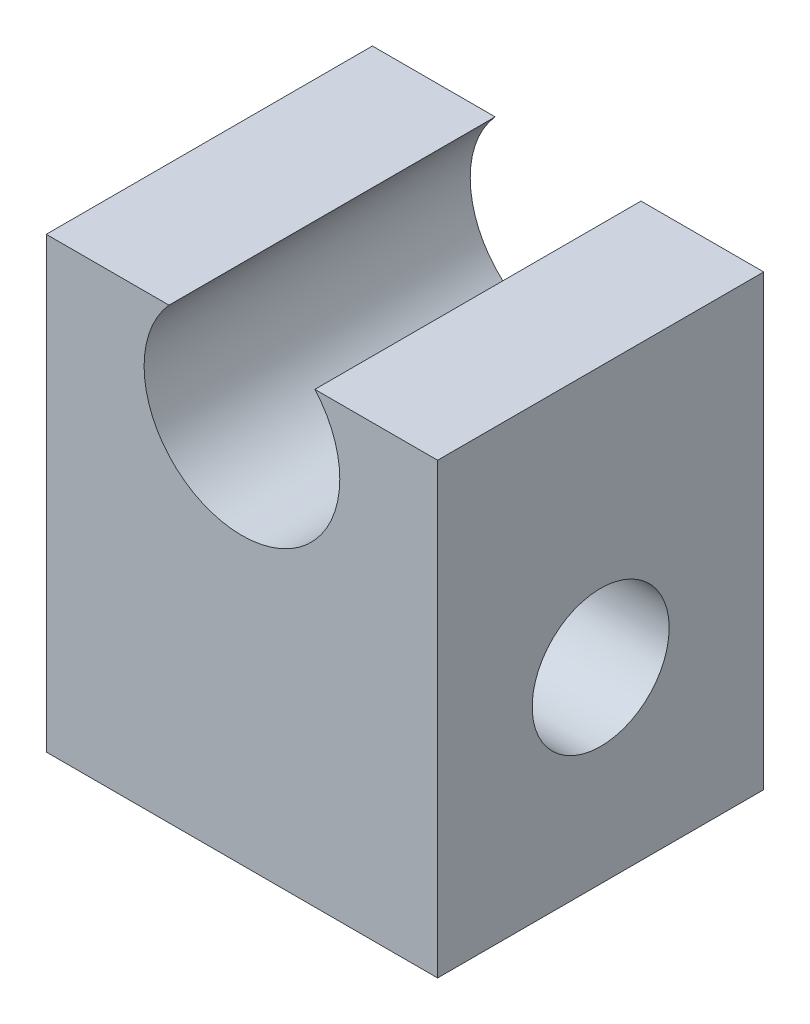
ISO-10303-21;
HEADER;
FILE_DESCRIPTION(('STEP AP214'),'2;1');
FILE_NAME('part.step','',(''),(''),'','','');
FILE_SCHEMA(('AUTOMOTIVE_DESIGN { 1 0 10303 214 1 1 1 1 }'));
ENDSEC;
DATA;
#1=APPLICATION_CONTEXT('core data for automotive mechanical design processes');
#2=APPLICATION_PROTOCOL_DEFINITION('international standard','automotive_design',2000,#1);
#3=PRODUCT_CONTEXT('',#1,'mechanical');
#4=PRODUCT('Part','Part','',(#3));
#5=PRODUCT_RELATED_PRODUCT_CATEGORY('part','',(#4));
#6=PRODUCT_DEFINITION_FORMATION('','',#4);
#7=PRODUCT_DEFINITION_CONTEXT('part definition',#1,'design');
#8=PRODUCT_DEFINITION('design','',#6,#7);
#9=PRODUCT_DEFINITION_SHAPE('','',#8);
#10=(LENGTH_UNIT() NAMED_UNIT(*) SI_UNIT(.MILLI.,.METRE.));
#11=(NAMED_UNIT(*) PLANE_ANGLE_UNIT() SI_UNIT($,.RADIAN.));
#12=(NAMED_UNIT(*) SI_UNIT($,.STERADIAN.) SOLID_ANGLE_UNIT());
#13=UNCERTAINTY_MEASURE_WITH_UNIT(LENGTH_MEASURE(1.E-05),#10,'distance_accuracy_value','');
#14=(GEOMETRIC_REPRESENTATION_CONTEXT(3) GLOBAL_UNCERTAINTY_ASSIGNED_CONTEXT((#13)) GLOBAL_UNIT_ASSIGNED_CONTEXT((#10,
#11,#12)) REPRESENTATION_CONTEXT('',''));
#15=CARTESIAN_POINT('',(0.,0.,0.));
#16=DIRECTION('',(0.,0.,1.));
#17=DIRECTION('',(1.,0.,0.));
#18=AXIS2_PLACEMENT_3D('',#15,#16,#17);
#19=CARTESIAN_POINT('',(-12.,4.,-10.));
#20=DIRECTION('',(0.,1.,0.));
#21=DIRECTION('',(0.,0.,1.));
#22=AXIS2_PLACEMENT_3D('',#19,#20,#21);
#23=PLANE('',#22);
#24=DIRECTION('',(0.,0.,1.));
#25=VECTOR('',#24,1.);
#26=CARTESIAN_POINT('',(-4.47213595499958,4.,-25.));
#27=LINE('',#26,#25);
#28=CARTESIAN_POINT('',(-4.47213595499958,4.,-10.));
#29=VERTEX_POINT('',#28);
#30=CARTESIAN_POINT('',(-4.47213595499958,4.,10.));
#31=VERTEX_POINT('',#30);
#32=EDGE_CURVE('E56',#29,#31,#27,.T.);
#33=ORIENTED_EDGE('',*,*,#32,.F.);
#34=DIRECTION('',(-1.,0.,0.));
#35=VECTOR('',#34,1.);
#36=CARTESIAN_POINT('',(-12.,4.,-10.));
#37=LINE('',#36,#35);
#38=CARTESIAN_POINT('',(-12.,4.,-10.));
#39=VERTEX_POINT('',#38);
#40=EDGE_CURVE('E63',#29,#39,#37,.T.);
#41=ORIENTED_EDGE('',*,*,#40,.T.);
#42=DIRECTION('',(0.,0.,1.));
#43=VECTOR('',#42,1.);
#44=CARTESIAN_POINT('',(-12.,4.,-10.));
#45=LINE('',#44,#43);
#46=CARTESIAN_POINT('',(-12.,4.,10.));
#47=VERTEX_POINT('',#46);
#48=EDGE_CURVE('E49',#39,#47,#45,.T.);
#49=ORIENTED_EDGE('',*,*,#48,.T.);
#50=DIRECTION('',(-1.,0.,0.));
#51=VECTOR('',#50,1.);
#52=CARTESIAN_POINT('',(-12.,4.,10.));
#53=LINE('',#52,#51);
#54=EDGE_CURVE('E77',#31,#47,#53,.T.);
#55=ORIENTED_EDGE('',*,*,#54,.F.);
#56=EDGE_LOOP('',(#33,#41,#49,#55));
#57=FACE_BOUND('',#56,.T.);
#58=ADVANCED_FACE('F41',(#57),#23,.T.);
#59=CARTESIAN_POINT('',(12.,-14.,-10.));
#60=DIRECTION('',(1.,0.,0.));
#61=DIRECTION('',(0.,0.,-1.));
#62=AXIS2_PLACEMENT_3D('',#59,#60,#61);
#63=PLANE('',#62);
#64=CARTESIAN_POINT('',(12.,-12.,0.));
#65=DIRECTION('',(1.,0.,0.));
#66=DIRECTION('',(0.,0.,-1.));
#67=AXIS2_PLACEMENT_3D('',#64,#65,#66);
#68=CIRCLE('',#67,4.2);
#69=CARTESIAN_POINT('',(12.,-12.,-4.2));
#70=VERTEX_POINT('',#69);
#71=EDGE_CURVE('E106',#70,#70,#68,.T.);
#72=ORIENTED_EDGE('',*,*,#71,.F.);
#73=EDGE_LOOP('',(#72));
#74=FACE_BOUND('',#73,.T.);
#75=DIRECTION('',(0.,1.,0.));
#76=VECTOR('',#75,1.);
#77=CARTESIAN_POINT('',(12.,-14.,-10.));
#78=LINE('',#77,#76);
#79=CARTESIAN_POINT('',(12.,-23.5,-10.));
#80=VERTEX_POINT('',#79);
#81=CARTESIAN_POINT('',(12.,4.,-10.));
#82=VERTEX_POINT('',#81);
#83=EDGE_CURVE('E97',#80,#82,#78,.T.);
#84=ORIENTED_EDGE('',*,*,#83,.T.);
#85=DIRECTION('',(0.,0.,1.));
#86=VECTOR('',#85,1.);
#87=CARTESIAN_POINT('',(12.,4.,-10.));
#88=LINE('',#87,#86);
#89=CARTESIAN_POINT('',(12.,4.,10.));
#90=VERTEX_POINT('',#89);
#91=EDGE_CURVE('E91',#82,#90,#88,.T.);
#92=ORIENTED_EDGE('',*,*,#91,.T.);
#93=DIRECTION('',(0.,1.,0.));
#94=VECTOR('',#93,1.);
#95=CARTESIAN_POINT('',(12.,-14.,10.));
#96=LINE('',#95,#94);
#97=CARTESIAN_POINT('',(12.,-23.5,10.));
#98=VERTEX_POINT('',#97);
#99=EDGE_CURVE('E86',#98,#90,#96,.T.);
#100=ORIENTED_EDGE('',*,*,#99,.F.);
#101=DIRECTION('',(0.,0.,1.));
#102=VECTOR('',#101,1.);
#103=CARTESIAN_POINT('',(12.,-23.5,-10.));
#104=LINE('',#103,#102);
#105=EDGE_CURVE('E125',#80,#98,#104,.T.);
#106=ORIENTED_EDGE('',*,*,#105,.F.);
#107=EDGE_LOOP('',(#84,#92,#100,#106));
#108=FACE_BOUND('',#107,.T.);
#109=ADVANCED_FACE('F43',(#74,#108),#63,.T.);
#110=CARTESIAN_POINT('',(-12.,-14.,-10.));
#111=DIRECTION('',(-1.,0.,0.));
#112=DIRECTION('',(0.,0.,1.));
#113=AXIS2_PLACEMENT_3D('',#110,#111,#112);
#114=PLANE('',#113);
#115=CARTESIAN_POINT('',(-12.,-12.,0.));
#116=DIRECTION('',(-1.,0.,0.));
#117=DIRECTION('',(0.,0.,1.));
#118=AXIS2_PLACEMENT_3D('',#115,#116,#117);
#119=CIRCLE('',#118,4.2);
#120=CARTESIAN_POINT('',(-12.,-12.,4.2));
#121=VERTEX_POINT('',#120);
#122=EDGE_CURVE('E104',#121,#121,#119,.T.);
#123=ORIENTED_EDGE('',*,*,#122,.F.);
#124=EDGE_LOOP('',(#123));
#125=FACE_BOUND('',#124,.T.);
#126=DIRECTION('',(0.,0.,1.));
#127=VECTOR('',#126,1.);
#128=CARTESIAN_POINT('',(-12.,-23.5,-10.));
#129=LINE('',#128,#127);
#130=CARTESIAN_POINT('',(-12.,-23.5,-10.));
#131=VERTEX_POINT('',#130);
#132=CARTESIAN_POINT('',(-12.,-23.5,10.));
#133=VERTEX_POINT('',#132);
#134=EDGE_CURVE('E95',#131,#133,#129,.T.);
#135=ORIENTED_EDGE('',*,*,#134,.T.);
#136=DIRECTION('',(0.,-1.,0.));
#137=VECTOR('',#136,1.);
#138=CARTESIAN_POINT('',(-12.,-14.,10.));
#139=LINE('',#138,#137);
#140=EDGE_CURVE('E83',#47,#133,#139,.T.);
#141=ORIENTED_EDGE('',*,*,#140,.F.);
#142=ORIENTED_EDGE('',*,*,#48,.F.);
#143=DIRECTION('',(0.,-1.,0.));
#144=VECTOR('',#143,1.);
#145=CARTESIAN_POINT('',(-12.,-14.,-10.));
#146=LINE('',#145,#144);
#147=EDGE_CURVE('E103',#39,#131,#146,.T.);
#148=ORIENTED_EDGE('',*,*,#147,.T.);
#149=EDGE_LOOP('',(#135,#141,#142,#148));
#150=FACE_BOUND('',#149,.T.);
#151=ADVANCED_FACE('F93',(#125,#150),#114,.T.);
#152=DIRECTION('',(0.,0.,1.));
#153=VECTOR('',#152,1.);
#154=CARTESIAN_POINT('',(4.47213595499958,4.,-25.));
#155=LINE('',#154,#153);
#156=CARTESIAN_POINT('',(4.47213595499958,4.,10.));
#157=VERTEX_POINT('',#156);
#158=CARTESIAN_POINT('',(4.47213595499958,4.,-10.));
#159=VERTEX_POINT('',#158);
#160=EDGE_CURVE('E117',#157,#159,#155,.F.);
#161=ORIENTED_EDGE('',*,*,#160,.F.);
#162=EDGE_CURVE('E85',#90,#157,#53,.T.);
#163=ORIENTED_EDGE('',*,*,#162,.F.);
#164=ORIENTED_EDGE('',*,*,#91,.F.);
#165=EDGE_CURVE('E129',#82,#159,#37,.T.);
#166=ORIENTED_EDGE('',*,*,#165,.T.);
#167=EDGE_LOOP('',(#161,#163,#164,#166));
#168=FACE_BOUND('',#167,.T.);
#169=ADVANCED_FACE('F143',(#168),#23,.T.);
#170=CARTESIAN_POINT('',(0.,0.,-10.));
#171=DIRECTION('',(0.,0.,-1.));
#172=DIRECTION('',(-1.,0.,0.));
#173=AXIS2_PLACEMENT_3D('',#170,#171,#172);
#174=PLANE('',#173);
#175=CARTESIAN_POINT('',(0.,0.,-10.));
#176=DIRECTION('',(0.,0.,-1.));
#177=DIRECTION('',(-1.,0.,0.));
#178=AXIS2_PLACEMENT_3D('',#175,#176,#177);
#179=CIRCLE('',#178,6.);
#180=EDGE_CURVE('E107',#159,#29,#179,.T.);
#181=ORIENTED_EDGE('',*,*,#180,.F.);
#182=ORIENTED_EDGE('',*,*,#165,.F.);
#183=ORIENTED_EDGE('',*,*,#83,.F.);
#184=DIRECTION('',(1.,0.,0.));
#185=VECTOR('',#184,1.);
#186=CARTESIAN_POINT('',(-12.,-23.5,-10.));
#187=LINE('',#186,#185);
#188=EDGE_CURVE('E121',#131,#80,#187,.T.);
#189=ORIENTED_EDGE('',*,*,#188,.F.);
#190=ORIENTED_EDGE('',*,*,#147,.F.);
#191=ORIENTED_EDGE('',*,*,#40,.F.);
#192=EDGE_LOOP('',(#181,#182,#183,#189,#190,#191));
#193=FACE_BOUND('',#192,.T.);
#194=ADVANCED_FACE('F149',(#193),#174,.T.);
#195=CARTESIAN_POINT('',(0.,0.,10.));
#196=DIRECTION('',(0.,0.,-1.));
#197=DIRECTION('',(-1.,0.,0.));
#198=AXIS2_PLACEMENT_3D('',#195,#196,#197);
#199=PLANE('',#198);
#200=ORIENTED_EDGE('',*,*,#162,.T.);
#201=CARTESIAN_POINT('',(0.,0.,10.));
#202=DIRECTION('',(0.,0.,-1.));
#203=DIRECTION('',(-1.,0.,0.));
#204=AXIS2_PLACEMENT_3D('',#201,#202,#203);
#205=CIRCLE('',#204,6.);
#206=EDGE_CURVE('E11',#157,#31,#205,.T.);
#207=ORIENTED_EDGE('',*,*,#206,.T.);
#208=ORIENTED_EDGE('',*,*,#54,.T.);
#209=ORIENTED_EDGE('',*,*,#140,.T.);
#210=DIRECTION('',(1.,0.,0.));
#211=VECTOR('',#210,1.);
#212=CARTESIAN_POINT('',(-12.,-23.5,10.));
#213=LINE('',#212,#211);
#214=EDGE_CURVE('E111',#133,#98,#213,.T.);
#215=ORIENTED_EDGE('',*,*,#214,.T.);
#216=ORIENTED_EDGE('',*,*,#99,.T.);
#217=EDGE_LOOP('',(#200,#207,#208,#209,#215,#216));
#218=FACE_BOUND('',#217,.T.);
#219=ADVANCED_FACE('F79',(#218),#199,.F.);
#220=CARTESIAN_POINT('',(-12.,-23.5,-10.));
#221=DIRECTION('',(0.,-1.,0.));
#222=DIRECTION('',(0.,0.,-1.));
#223=AXIS2_PLACEMENT_3D('',#220,#221,#222);
#224=PLANE('',#223);
#225=ORIENTED_EDGE('',*,*,#214,.F.);
#226=ORIENTED_EDGE('',*,*,#134,.F.);
#227=ORIENTED_EDGE('',*,*,#188,.T.);
#228=ORIENTED_EDGE('',*,*,#105,.T.);
#229=EDGE_LOOP('',(#225,#226,#227,#228));
#230=FACE_BOUND('',#229,.T.);
#231=ADVANCED_FACE('F157',(#230),#224,.T.);
#232=CARTESIAN_POINT('',(-25.,-12.,0.));
#233=DIRECTION('',(1.,0.,0.));
#234=DIRECTION('',(0.,0.,-1.));
#235=AXIS2_PLACEMENT_3D('',#232,#233,#234);
#236=CYLINDRICAL_SURFACE('',#235,4.2);
#237=ORIENTED_EDGE('',*,*,#71,.T.);
#238=EDGE_LOOP('',(#237));
#239=FACE_BOUND('',#238,.T.);
#240=ORIENTED_EDGE('',*,*,#122,.T.);
#241=EDGE_LOOP('',(#240));
#242=FACE_BOUND('',#241,.T.);
#243=ADVANCED_FACE('F159',(#239,#242),#236,.F.);
#244=CARTESIAN_POINT('',(0.,0.,-25.));
#245=DIRECTION('',(0.,0.,1.));
#246=DIRECTION('',(1.,0.,0.));
#247=AXIS2_PLACEMENT_3D('',#244,#245,#246);
#248=CYLINDRICAL_SURFACE('',#247,6.);
#249=ORIENTED_EDGE('',*,*,#180,.T.);
#250=ORIENTED_EDGE('',*,*,#32,.T.);
#251=ORIENTED_EDGE('',*,*,#206,.F.);
#252=ORIENTED_EDGE('',*,*,#160,.T.);
#253=EDGE_LOOP('',(#249,#250,#251,#252));
#254=FACE_BOUND('',#253,.T.);
#255=ADVANCED_FACE('F146',(#254),#248,.F.);
#256=CLOSED_SHELL('',(#58,#109,#151,#169,#194,#219,#231,#243,#255));
#257=MANIFOLD_SOLID_BREP('B2',#256);
#258=ADVANCED_BREP_SHAPE_REPRESENTATION('',(#18,#257),#14);
#259=SHAPE_DEFINITION_REPRESENTATION(#9,#258);
ENDSEC;
END-ISO-10303-21;
